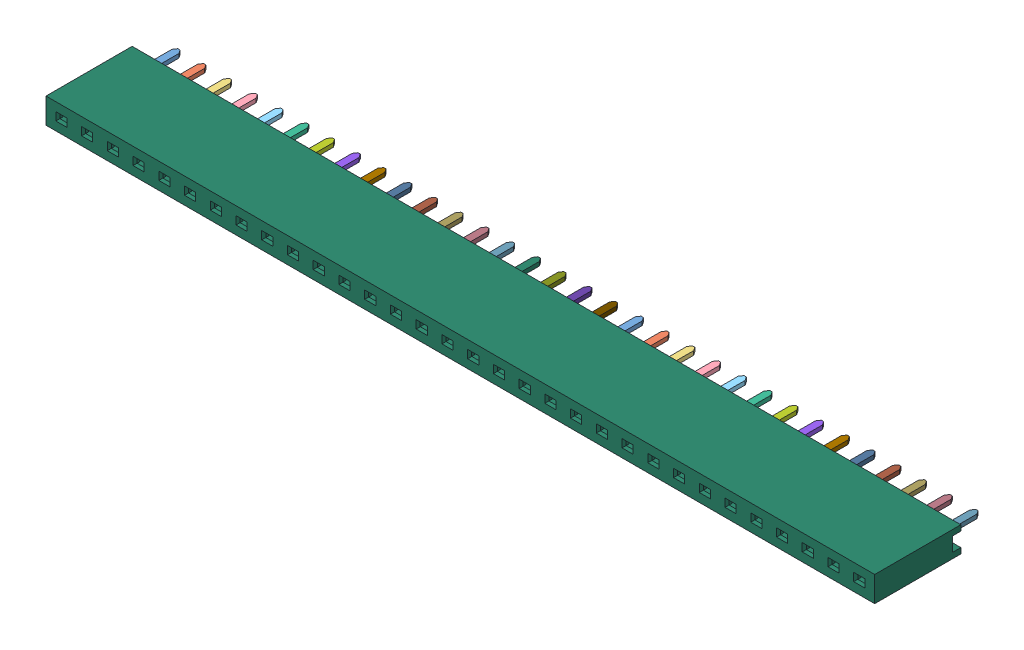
SolidWorks assembly 61303211821.SLDASM, configuration Default (file format 8000). Lengths in mm.
Overall size (81.78 2.5 11.6).
33 component instances, 33 part files, 0 mates.
Components (placement in the parent):
- 61303211821_01-1: 61303211821_01.SLDPRT [Default] at origin size (2 0.4 10.2)
- 61303211821_02-1: 61303211821_02.SLDPRT [Default] at origin size (2 0.4 10.2)
- 61303211821_03-1: 61303211821_03.SLDPRT [Default] at origin size (2 0.4 10.2)
- 61303211821_04-1: 61303211821_04.SLDPRT [Default] at origin size (2 0.4 10.2)
- 61303211821_05-1: 61303211821_05.SLDPRT [Default] at origin size (2 0.4 10.2)
- 61303211821_06-1: 61303211821_06.SLDPRT [Default] at origin size (2 0.4 10.2)
- 61303211821_07-1: 61303211821_07.SLDPRT [Default] at origin size (2 0.4 10.2)
- 61303211821_08-1: 61303211821_08.SLDPRT [Default] at origin size (2 0.4 10.2)
- 61303211821_09-1: 61303211821_09.SLDPRT [Default] at origin size (2 0.4 10.2)
- 61303211821_10-1: 61303211821_10.SLDPRT [Default] at origin size (2 0.4 10.2)
- 61303211821_11-1: 61303211821_11.SLDPRT [Default] at origin size (2 0.4 10.2)
- 61303211821_12-1: 61303211821_12.SLDPRT [Default] at origin size (2 0.4 10.2)
- 61303211821_13-1: 61303211821_13.SLDPRT [Default] at origin size (2 0.4 10.2)
- 61303211821_14-1: 61303211821_14.SLDPRT [Default] at origin size (2 0.4 10.2)
- 61303211821_15-1: 61303211821_15.SLDPRT [Default] at origin size (2 0.4 10.2)
- 61303211821_16-1: 61303211821_16.SLDPRT [Default] at origin size (2 0.4 10.2)
- 61303211821_17-1: 61303211821_17.SLDPRT [Default] at origin size (2 0.4 10.2)
- 61303211821_18-1: 61303211821_18.SLDPRT [Default] at origin size (2 0.4 10.2)
- 61303211821_19-1: 61303211821_19.SLDPRT [Default] at origin size (2 0.4 10.2)
- 61303211821_20-1: 61303211821_20.SLDPRT [Default] at origin size (2 0.4 10.2)
- 61303211821_21-1: 61303211821_21.SLDPRT [Default] at origin size (2 0.4 10.2)
- 61303211821_22-1: 61303211821_22.SLDPRT [Default] at origin size (2 0.4 10.2)
- 61303211821_23-1: 61303211821_23.SLDPRT [Default] at origin size (2 0.4 10.2)
- 61303211821_24-1: 61303211821_24.SLDPRT [Default] at origin size (2 0.4 10.2)
- 61303211821_25-1: 61303211821_25.SLDPRT [Default] at origin size (2 0.4 10.2)
- 61303211821_26-1: 61303211821_26.SLDPRT [Default] at origin size (2 0.4 10.2)
- 61303211821_27-1: 61303211821_27.SLDPRT [Default] at origin size (2 0.4 10.2)
- 61303211821_28-1: 61303211821_28.SLDPRT [Default] at origin size (2 0.4 10.2)
- 61303211821_29-1: 61303211821_29.SLDPRT [Default] at origin size (2 0.4 10.2)
- 61303211821_30-1: 61303211821_30.SLDPRT [Default] at origin size (2 0.4 10.2)
- 61303211821_31-1: 61303211821_31.SLDPRT [Default] at origin size (2 0.4 10.2)
- 61303211821_32-1: 61303211821_32.SLDPRT [Default] at origin size (2 0.4 10.2)
- 61303211821_33-1: 61303211821_33.SLDPRT [Default] at origin size (81.78 2.5 8.5)
